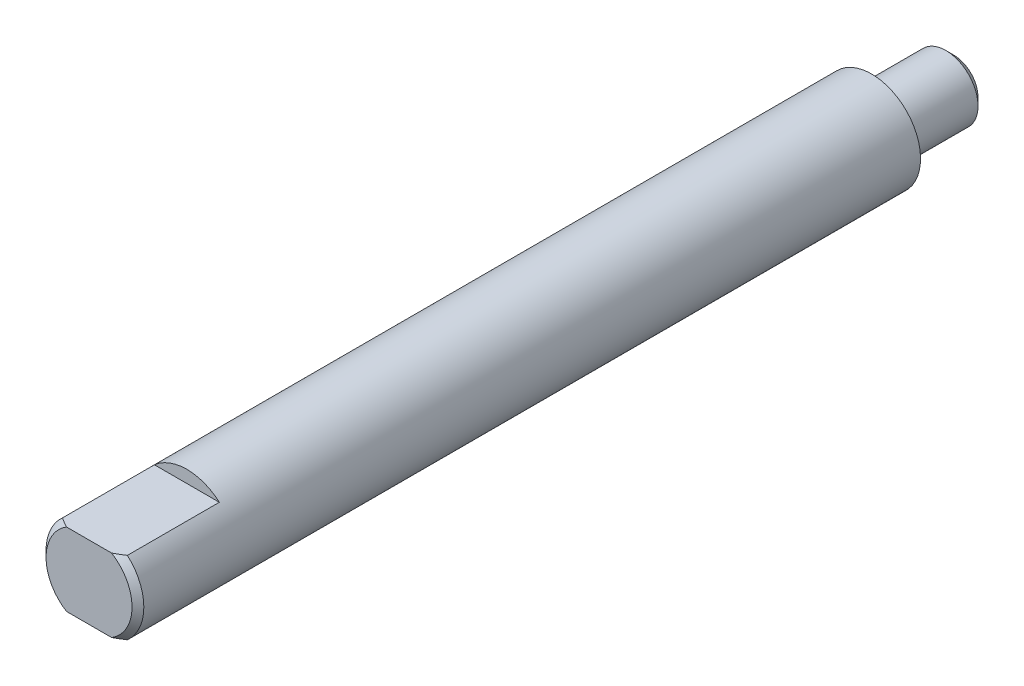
ISO-10303-21;
HEADER;
FILE_DESCRIPTION(('STEP AP214'),'2;1');
FILE_NAME('part.step','',(''),(''),'','','');
FILE_SCHEMA(('AUTOMOTIVE_DESIGN { 1 0 10303 214 1 1 1 1 }'));
ENDSEC;
DATA;
#1=APPLICATION_CONTEXT('core data for automotive mechanical design processes');
#2=APPLICATION_PROTOCOL_DEFINITION('international standard','automotive_design',2000,#1);
#3=PRODUCT_CONTEXT('',#1,'mechanical');
#4=PRODUCT('Part','Part','',(#3));
#5=PRODUCT_RELATED_PRODUCT_CATEGORY('part','',(#4));
#6=PRODUCT_DEFINITION_FORMATION('','',#4);
#7=PRODUCT_DEFINITION_CONTEXT('part definition',#1,'design');
#8=PRODUCT_DEFINITION('design','',#6,#7);
#9=PRODUCT_DEFINITION_SHAPE('','',#8);
#10=(LENGTH_UNIT() NAMED_UNIT(*) SI_UNIT(.MILLI.,.METRE.));
#11=(NAMED_UNIT(*) PLANE_ANGLE_UNIT() SI_UNIT($,.RADIAN.));
#12=(NAMED_UNIT(*) SI_UNIT($,.STERADIAN.) SOLID_ANGLE_UNIT());
#13=UNCERTAINTY_MEASURE_WITH_UNIT(LENGTH_MEASURE(1.E-05),#10,'distance_accuracy_value','');
#14=(GEOMETRIC_REPRESENTATION_CONTEXT(3) GLOBAL_UNCERTAINTY_ASSIGNED_CONTEXT((#13)) GLOBAL_UNIT_ASSIGNED_CONTEXT((#10,
#11,#12)) REPRESENTATION_CONTEXT('',''));
#15=CARTESIAN_POINT('',(0.,0.,0.));
#16=DIRECTION('',(0.,0.,1.));
#17=DIRECTION('',(1.,0.,0.));
#18=AXIS2_PLACEMENT_3D('',#15,#16,#17);
#19=CARTESIAN_POINT('',(0.,0.,3.684));
#20=DIRECTION('',(0.,0.,-1.));
#21=DIRECTION('',(0.,1.,0.));
#22=AXIS2_PLACEMENT_3D('',#19,#20,#21);
#23=CONICAL_SURFACE('',#22,3.175,0.791934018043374);
#24=CARTESIAN_POINT('',(0.,0.,3.684));
#25=DIRECTION('',(0.,0.,1.));
#26=DIRECTION('',(0.,-1.,0.));
#27=AXIS2_PLACEMENT_3D('',#24,#25,#26);
#28=CIRCLE('',#27,3.175);
#29=CARTESIAN_POINT('',(-2.10713075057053,2.37500000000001,3.684));
#30=VERTEX_POINT('',#29);
#31=CARTESIAN_POINT('',(-2.10713075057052,-2.37500000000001,3.684));
#32=VERTEX_POINT('',#31);
#33=EDGE_CURVE('E105',#30,#32,#28,.T.);
#34=ORIENTED_EDGE('',*,*,#33,.T.);
#35=CARTESIAN_POINT('',(-6.62966945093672,-2.37500000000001,-0.133015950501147));
#36=CARTESIAN_POINT('',(-6.4187208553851,-2.37500000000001,0.0629362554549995));
#37=CARTESIAN_POINT('',(-6.20729327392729,-2.37500000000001,0.258380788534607));
#38=CARTESIAN_POINT('',(-5.78286017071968,-2.37500000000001,0.647887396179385));
#39=CARTESIAN_POINT('',(-5.56985352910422,-2.37500000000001,0.841948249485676));
#40=CARTESIAN_POINT('',(-5.13574053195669,-2.37500000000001,1.23363349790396));
#41=CARTESIAN_POINT('',(-4.91457904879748,-2.37500000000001,1.43119690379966));
#42=CARTESIAN_POINT('',(-4.46963283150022,-2.37500000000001,1.82304516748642));
#43=CARTESIAN_POINT('',(-4.24585006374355,-2.37500000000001,2.01733224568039));
#44=CARTESIAN_POINT('',(-3.90719638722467,-2.37500000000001,2.30510248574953));
#45=CARTESIAN_POINT('',(-3.79385459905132,-2.37500000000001,2.40038380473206));
#46=CARTESIAN_POINT('',(-3.56590809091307,-2.37500000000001,2.58942155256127));
#47=CARTESIAN_POINT('',(-3.45130340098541,-2.37500000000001,2.6831780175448));
#48=CARTESIAN_POINT('',(-3.22025369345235,-2.37500000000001,2.86895465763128));
#49=CARTESIAN_POINT('',(-3.10380502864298,-2.37500000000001,2.96097030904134));
#50=CARTESIAN_POINT('',(-2.86892224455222,-2.37500000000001,3.1424196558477));
#51=CARTESIAN_POINT('',(-2.75048831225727,-2.37500000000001,3.23185359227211));
#52=CARTESIAN_POINT('',(-2.51255729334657,-2.37500000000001,3.40617108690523));
#53=CARTESIAN_POINT('',(-2.39309165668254,-2.37500000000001,3.49109735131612));
#54=CARTESIAN_POINT('',(-2.15090508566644,-2.37500000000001,3.65634247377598));
#55=CARTESIAN_POINT('',(-2.02818269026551,-2.37500000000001,3.73665921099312));
#56=CARTESIAN_POINT('',(-1.77912466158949,-2.37500000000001,3.89039659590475));
#57=CARTESIAN_POINT('',(-1.65280524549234,-2.37500000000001,3.96384327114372));
#58=CARTESIAN_POINT('',(-1.39512518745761,-2.37500000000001,4.10119391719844));
#59=CARTESIAN_POINT('',(-1.26377071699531,-2.37500000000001,4.16510912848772));
#60=CARTESIAN_POINT('',(-1.05701971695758,-2.37500000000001,4.25273595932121));
#61=CARTESIAN_POINT('',(-0.983728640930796,-2.37500000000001,4.28140199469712));
#62=CARTESIAN_POINT('',(-0.835356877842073,-2.37500000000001,4.33377721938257));
#63=CARTESIAN_POINT('',(-0.760275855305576,-2.37500000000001,4.35748547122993));
#64=CARTESIAN_POINT('',(-0.608898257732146,-2.37500000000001,4.39885359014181));
#65=CARTESIAN_POINT('',(-0.532610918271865,-2.37500000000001,4.41654679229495));
#66=CARTESIAN_POINT('',(-0.378780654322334,-2.37500000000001,4.44515427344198));
#67=CARTESIAN_POINT('',(-0.301238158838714,-2.37500000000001,4.45607082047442));
#68=CARTESIAN_POINT('',(-0.144559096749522,-2.37500000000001,4.47054748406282));
#69=CARTESIAN_POINT('',(-0.0654144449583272,-2.37500000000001,4.47402190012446));
#70=CARTESIAN_POINT('',(0.0928249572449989,-2.37500000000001,4.47312081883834));
#71=CARTESIAN_POINT('',(0.171919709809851,-2.37500000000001,4.4687456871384));
#72=CARTESIAN_POINT('',(0.329626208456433,-2.37500000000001,4.45241265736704));
#73=CARTESIAN_POINT('',(0.408234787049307,-2.37500000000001,4.44042470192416));
#74=CARTESIAN_POINT('',(0.564086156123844,-2.37500000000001,4.40957980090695));
#75=CARTESIAN_POINT('',(0.64132857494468,-2.37500000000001,4.39072101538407));
#76=CARTESIAN_POINT('',(0.827865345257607,-2.37500000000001,4.33746225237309));
#77=CARTESIAN_POINT('',(0.936246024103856,-2.37500000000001,4.29987709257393));
#78=CARTESIAN_POINT('',(1.1492749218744,-2.37500000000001,4.21535984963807));
#79=CARTESIAN_POINT('',(1.25392057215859,-2.37500000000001,4.16842147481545));
#80=CARTESIAN_POINT('',(1.46087103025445,-2.37500000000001,4.06709514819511));
#81=CARTESIAN_POINT('',(1.56313950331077,-2.37500000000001,4.01263383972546));
#82=CARTESIAN_POINT('',(1.71427099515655,-2.37500000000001,3.92703840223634));
#83=CARTESIAN_POINT('',(1.76426245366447,-2.37500000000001,3.89786057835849));
#84=CARTESIAN_POINT('',(1.86356372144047,-2.37500000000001,3.83837009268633));
#85=CARTESIAN_POINT('',(1.91287355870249,-2.37500000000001,3.80805747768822));
#86=CARTESIAN_POINT('',(2.07522042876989,-2.37500000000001,3.70601224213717));
#87=CARTESIAN_POINT('',(2.18692206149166,-2.37500000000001,3.63215349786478));
#88=CARTESIAN_POINT('',(2.40772318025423,-2.37500000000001,3.48062951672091));
#89=CARTESIAN_POINT('',(2.51682205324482,-2.37500000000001,3.40296339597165));
#90=CARTESIAN_POINT('',(2.73301390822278,-2.37500000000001,3.24473477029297));
#91=CARTESIAN_POINT('',(2.84010537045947,-2.37500000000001,3.1641701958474));
#92=CARTESIAN_POINT('',(3.05261723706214,-2.37500000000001,3.00086187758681));
#93=CARTESIAN_POINT('',(3.15803753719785,-2.37500000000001,2.91811799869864));
#94=CARTESIAN_POINT('',(3.47300086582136,-2.37500000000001,2.66679989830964));
#95=CARTESIAN_POINT('',(3.6805144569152,-2.37500000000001,2.49568568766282));
#96=CARTESIAN_POINT('',(4.09182405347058,-2.37500000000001,2.1492611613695));
#97=CARTESIAN_POINT('',(4.29562161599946,-2.37500000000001,1.97395267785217));
#98=CARTESIAN_POINT('',(4.67931232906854,-2.37500000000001,1.6390553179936));
#99=CARTESIAN_POINT('',(4.85946034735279,-2.37500000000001,1.4797578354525));
#100=CARTESIAN_POINT('',(5.21824582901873,-2.37500000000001,1.15942835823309));
#101=CARTESIAN_POINT('',(5.39688309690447,-2.37500000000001,0.99839614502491));
#102=CARTESIAN_POINT('',(5.75173692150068,-2.37500000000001,0.676174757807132));
#103=CARTESIAN_POINT('',(5.92796166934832,-2.37500000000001,0.514994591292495));
#104=CARTESIAN_POINT('',(6.27946145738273,-2.37500000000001,0.191659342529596));
#105=CARTESIAN_POINT('',(6.45473664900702,-2.37500000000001,0.0295044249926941));
#106=CARTESIAN_POINT('',(6.62966945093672,-2.37500000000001,-0.133015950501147));
#107=B_SPLINE_CURVE_WITH_KNOTS('',3,(#35,#36,#37,#38,#39,#40,#41,#42,#43,#44,#45,#46,#47,#48,
#49,#50,#51,#52,#53,#54,#55,#56,#57,#58,#59,#60,#61,#62,#63,#64,#65,#66,#67,#68,#69,#70,#71,#72,
#73,#74,#75,#76,#77,#78,#79,#80,#81,#82,#83,#84,#85,#86,#87,#88,#89,#90,#91,#92,#93,#94,#95,#96,
#97,#98,#99,#100,#101,#102,#103,#104,#105,#106),.UNSPECIFIED.,.F.,.F.,(4,2,2,2,2,2,2,2,2,2,2,2,
2,2,2,2,2,2,2,2,2,2,2,2,2,2,2,2,2,2,2,2,2,2,2,4),(0.,0.863760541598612,1.72820709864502,
2.61784876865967,3.50686109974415,3.95106286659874,4.39525409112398,4.8404739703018,
5.2856521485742,5.72530383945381,6.16515621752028,6.60326828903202,7.04085953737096,
7.27681206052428,7.51280915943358,7.74747620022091,7.98206465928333,8.21934033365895,
8.45660495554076,8.69481223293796,8.93308334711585,9.27660606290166,9.62036064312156,
9.96774119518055,10.1413805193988,10.3150126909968,10.7166254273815,11.118331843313,
11.5203310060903,11.9223551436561,12.7291420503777,13.535582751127,14.2569976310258,
14.9785044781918,15.6949553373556,16.4112883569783),.UNSPECIFIED.);
#108=CARTESIAN_POINT('',(-1.4640611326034,-2.37500000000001,4.064));
#109=VERTEX_POINT('',#108);
#110=EDGE_CURVE('E128',#32,#109,#107,.T.);
#111=ORIENTED_EDGE('',*,*,#110,.T.);
#112=CARTESIAN_POINT('',(0.,0.,4.064));
#113=DIRECTION('',(0.,0.,1.));
#114=DIRECTION('',(0.,-1.,0.));
#115=AXIS2_PLACEMENT_3D('',#112,#113,#114);
#116=CIRCLE('',#115,2.79);
#117=CARTESIAN_POINT('',(-1.46406113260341,2.37500000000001,4.064));
#118=VERTEX_POINT('',#117);
#119=EDGE_CURVE('E115',#118,#109,#116,.T.);
#120=ORIENTED_EDGE('',*,*,#119,.F.);
#121=CARTESIAN_POINT('',(6.62966945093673,2.37500000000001,-0.133015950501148));
#122=CARTESIAN_POINT('',(6.4187208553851,2.37500000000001,0.062936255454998));
#123=CARTESIAN_POINT('',(6.2072932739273,2.37500000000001,0.258380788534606));
#124=CARTESIAN_POINT('',(5.78286017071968,2.37500000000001,0.647887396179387));
#125=CARTESIAN_POINT('',(5.56985352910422,2.37500000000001,0.841948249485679));
#126=CARTESIAN_POINT('',(5.13574053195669,2.37500000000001,1.23363349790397));
#127=CARTESIAN_POINT('',(4.91457904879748,2.37500000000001,1.43119690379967));
#128=CARTESIAN_POINT('',(4.46963283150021,2.37500000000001,1.82304516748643));
#129=CARTESIAN_POINT('',(4.24585006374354,2.37500000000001,2.0173322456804));
#130=CARTESIAN_POINT('',(3.90719638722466,2.37500000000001,2.30510248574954));
#131=CARTESIAN_POINT('',(3.79385459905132,2.37500000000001,2.40038380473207));
#132=CARTESIAN_POINT('',(3.56590809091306,2.37500000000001,2.58942155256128));
#133=CARTESIAN_POINT('',(3.4513034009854,2.37500000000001,2.68317801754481));
#134=CARTESIAN_POINT('',(3.22025369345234,2.37500000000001,2.86895465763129));
#135=CARTESIAN_POINT('',(3.10380502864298,2.37500000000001,2.96097030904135));
#136=CARTESIAN_POINT('',(2.86892224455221,2.37500000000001,3.14241965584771));
#137=CARTESIAN_POINT('',(2.75048831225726,2.37500000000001,3.23185359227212));
#138=CARTESIAN_POINT('',(2.51255729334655,2.37500000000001,3.40617108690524));
#139=CARTESIAN_POINT('',(2.39309165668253,2.37500000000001,3.49109735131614));
#140=CARTESIAN_POINT('',(2.15090508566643,2.37500000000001,3.65634247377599));
#141=CARTESIAN_POINT('',(2.0281826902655,2.37500000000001,3.73665921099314));
#142=CARTESIAN_POINT('',(1.77912466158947,2.37500000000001,3.89039659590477));
#143=CARTESIAN_POINT('',(1.65280524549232,2.37500000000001,3.96384327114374));
#144=CARTESIAN_POINT('',(1.3951251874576,2.37500000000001,4.10119391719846));
#145=CARTESIAN_POINT('',(1.26377071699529,2.37500000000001,4.16510912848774));
#146=CARTESIAN_POINT('',(1.05701971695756,2.37500000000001,4.25273595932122));
#147=CARTESIAN_POINT('',(0.983728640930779,2.37500000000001,4.28140199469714));
#148=CARTESIAN_POINT('',(0.835356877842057,2.37500000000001,4.33377721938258));
#149=CARTESIAN_POINT('',(0.76027585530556,2.37500000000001,4.35748547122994));
#150=CARTESIAN_POINT('',(0.608898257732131,2.37500000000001,4.39885359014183));
#151=CARTESIAN_POINT('',(0.532610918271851,2.37500000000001,4.41654679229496));
#152=CARTESIAN_POINT('',(0.378780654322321,2.37500000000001,4.44515427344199));
#153=CARTESIAN_POINT('',(0.301238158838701,2.37500000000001,4.45607082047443));
#154=CARTESIAN_POINT('',(0.14455909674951,2.37500000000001,4.47054748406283));
#155=CARTESIAN_POINT('',(0.0654144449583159,2.37500000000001,4.47402190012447));
#156=CARTESIAN_POINT('',(-0.0928249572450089,2.37500000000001,4.47312081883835));
#157=CARTESIAN_POINT('',(-0.17191970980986,2.37500000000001,4.46874568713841));
#158=CARTESIAN_POINT('',(-0.32962620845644,2.37500000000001,4.45241265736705));
#159=CARTESIAN_POINT('',(-0.408234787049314,2.37500000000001,4.44042470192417));
#160=CARTESIAN_POINT('',(-0.56408615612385,2.37500000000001,4.40957980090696));
#161=CARTESIAN_POINT('',(-0.641328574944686,2.37500000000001,4.39072101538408));
#162=CARTESIAN_POINT('',(-0.827865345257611,2.37500000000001,4.3374622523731));
#163=CARTESIAN_POINT('',(-0.936246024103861,2.37500000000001,4.29987709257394));
#164=CARTESIAN_POINT('',(-1.1492749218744,2.37500000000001,4.21535984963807));
#165=CARTESIAN_POINT('',(-1.25392057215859,2.37500000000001,4.16842147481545));
#166=CARTESIAN_POINT('',(-1.46087103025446,2.37500000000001,4.06709514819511));
#167=CARTESIAN_POINT('',(-1.56313950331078,2.37500000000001,4.01263383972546));
#168=CARTESIAN_POINT('',(-1.71427099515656,2.37500000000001,3.92703840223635));
#169=CARTESIAN_POINT('',(-1.76426245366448,2.37500000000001,3.8978605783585));
#170=CARTESIAN_POINT('',(-1.86356372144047,2.37500000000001,3.83837009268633));
#171=CARTESIAN_POINT('',(-1.9128735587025,2.37500000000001,3.80805747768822));
#172=CARTESIAN_POINT('',(-2.0752204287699,2.37500000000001,3.70601224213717));
#173=CARTESIAN_POINT('',(-2.18692206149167,2.37500000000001,3.63215349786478));
#174=CARTESIAN_POINT('',(-2.40772318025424,2.37500000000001,3.48062951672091));
#175=CARTESIAN_POINT('',(-2.51682205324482,2.37500000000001,3.40296339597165));
#176=CARTESIAN_POINT('',(-2.73301390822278,2.37500000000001,3.24473477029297));
#177=CARTESIAN_POINT('',(-2.84010537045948,2.37500000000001,3.1641701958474));
#178=CARTESIAN_POINT('',(-3.05261723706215,2.37500000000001,3.00086187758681));
#179=CARTESIAN_POINT('',(-3.15803753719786,2.37500000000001,2.91811799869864));
#180=CARTESIAN_POINT('',(-3.47300086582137,2.37500000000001,2.66679989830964));
#181=CARTESIAN_POINT('',(-3.68051445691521,2.37500000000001,2.49568568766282));
#182=CARTESIAN_POINT('',(-4.09182405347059,2.37500000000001,2.1492611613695));
#183=CARTESIAN_POINT('',(-4.29562161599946,2.37500000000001,1.97395267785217));
#184=CARTESIAN_POINT('',(-4.67931232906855,2.37500000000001,1.6390553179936));
#185=CARTESIAN_POINT('',(-4.8594603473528,2.37500000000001,1.47975783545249));
#186=CARTESIAN_POINT('',(-5.21824582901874,2.37500000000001,1.15942835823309));
#187=CARTESIAN_POINT('',(-5.39688309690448,2.37500000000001,0.998396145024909));
#188=CARTESIAN_POINT('',(-5.75173692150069,2.37500000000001,0.676174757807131));
#189=CARTESIAN_POINT('',(-5.92796166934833,2.37500000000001,0.514994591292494));
#190=CARTESIAN_POINT('',(-6.27946145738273,2.37500000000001,0.191659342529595));
#191=CARTESIAN_POINT('',(-6.45473664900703,2.37500000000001,0.029504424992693));
#192=CARTESIAN_POINT('',(-6.62966945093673,2.37500000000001,-0.133015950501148));
#193=B_SPLINE_CURVE_WITH_KNOTS('',3,(#121,#122,#123,#124,#125,#126,#127,#128,#129,#130,#131,
#132,#133,#134,#135,#136,#137,#138,#139,#140,#141,#142,#143,#144,#145,#146,#147,#148,#149,#150,
#151,#152,#153,#154,#155,#156,#157,#158,#159,#160,#161,#162,#163,#164,#165,#166,#167,#168,#169,
#170,#171,#172,#173,#174,#175,#176,#177,#178,#179,#180,#181,#182,#183,#184,#185,#186,#187,#188,
#189,#190,#191,#192),.UNSPECIFIED.,.F.,.F.,(4,2,2,2,2,2,2,2,2,2,2,2,2,2,2,2,2,2,2,2,2,2,2,2,2,2,
2,2,2,2,2,2,2,2,2,4),(0.,0.863760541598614,1.72820709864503,2.61784876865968,3.50686109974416,
3.95106286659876,4.395254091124,4.84047397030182,5.28565214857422,5.72530383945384,
6.16515621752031,6.60326828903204,7.04085953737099,7.27681206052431,7.5128091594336,
7.74747620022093,7.98206465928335,8.21934033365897,8.45660495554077,8.69481223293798,
8.93308334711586,9.27660606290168,9.62036064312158,9.96774119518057,10.1413805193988,
10.3150126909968,10.7166254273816,11.118331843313,11.5203310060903,11.9223551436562,
12.7291420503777,13.535582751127,14.2569976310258,14.9785044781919,15.6949553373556,
16.4112883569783),.UNSPECIFIED.);
#194=EDGE_CURVE('E129',#118,#30,#193,.T.);
#195=ORIENTED_EDGE('',*,*,#194,.T.);
#196=EDGE_LOOP('',(#34,#111,#120,#195));
#197=FACE_BOUND('',#196,.T.);
#198=ADVANCED_FACE('F33',(#197),#23,.T.);
#199=CARTESIAN_POINT('',(0.,0.,4.064));
#200=DIRECTION('',(0.,0.,-1.));
#201=DIRECTION('',(0.,1.,0.));
#202=AXIS2_PLACEMENT_3D('',#199,#200,#201);
#203=PLANE('',#202);
#204=ORIENTED_EDGE('',*,*,#119,.T.);
#205=DIRECTION('',(1.,0.,0.));
#206=VECTOR('',#205,1.);
#207=CARTESIAN_POINT('',(-5.,-2.37500000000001,4.064));
#208=LINE('',#207,#206);
#209=CARTESIAN_POINT('',(1.4640611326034,-2.37500000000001,4.064));
#210=VERTEX_POINT('',#209);
#211=EDGE_CURVE('E95',#109,#210,#208,.T.);
#212=ORIENTED_EDGE('',*,*,#211,.T.);
#213=CARTESIAN_POINT('',(1.46406113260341,2.37500000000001,4.064));
#214=VERTEX_POINT('',#213);
#215=EDGE_CURVE('E109',#210,#214,#116,.T.);
#216=ORIENTED_EDGE('',*,*,#215,.T.);
#217=DIRECTION('',(1.,0.,0.));
#218=VECTOR('',#217,1.);
#219=CARTESIAN_POINT('',(-5.,2.37500000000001,4.064));
#220=LINE('',#219,#218);
#221=EDGE_CURVE('E135',#118,#214,#220,.T.);
#222=ORIENTED_EDGE('',*,*,#221,.F.);
#223=EDGE_LOOP('',(#204,#212,#216,#222));
#224=FACE_BOUND('',#223,.T.);
#225=ADVANCED_FACE('F35',(#224),#203,.F.);
#226=ORIENTED_EDGE('',*,*,#215,.F.);
#227=CARTESIAN_POINT('',(2.10713075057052,-2.37500000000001,3.684));
#228=VERTEX_POINT('',#227);
#229=EDGE_CURVE('E94',#210,#228,#107,.T.);
#230=ORIENTED_EDGE('',*,*,#229,.T.);
#231=CARTESIAN_POINT('',(2.10713075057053,2.37500000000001,3.684));
#232=VERTEX_POINT('',#231);
#233=EDGE_CURVE('E101',#228,#232,#28,.T.);
#234=ORIENTED_EDGE('',*,*,#233,.T.);
#235=EDGE_CURVE('E132',#232,#214,#193,.T.);
#236=ORIENTED_EDGE('',*,*,#235,.T.);
#237=EDGE_LOOP('',(#226,#230,#234,#236));
#238=FACE_BOUND('',#237,.T.);
#239=ADVANCED_FACE('F144',(#238),#23,.T.);
#240=CARTESIAN_POINT('',(0.,0.,4.064));
#241=DIRECTION('',(0.,0.,1.));
#242=DIRECTION('',(0.,-1.,0.));
#243=AXIS2_PLACEMENT_3D('',#240,#241,#242);
#244=CYLINDRICAL_SURFACE('',#243,3.17499999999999);
#245=ORIENTED_EDGE('',*,*,#233,.F.);
#246=DIRECTION('',(0.,0.,1.));
#247=VECTOR('',#246,1.);
#248=CARTESIAN_POINT('',(2.10713075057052,-2.37500000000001,4.064));
#249=LINE('',#248,#247);
#250=CARTESIAN_POINT('',(2.10713075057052,-2.37500000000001,-2.286));
#251=VERTEX_POINT('',#250);
#252=EDGE_CURVE('E11',#228,#251,#249,.F.);
#253=ORIENTED_EDGE('',*,*,#252,.T.);
#254=CARTESIAN_POINT('',(0.,0.,-2.286));
#255=DIRECTION('',(0.,0.,-1.));
#256=DIRECTION('',(-1.,0.,0.));
#257=AXIS2_PLACEMENT_3D('',#254,#255,#256);
#258=CIRCLE('',#257,3.17499999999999);
#259=CARTESIAN_POINT('',(-2.10713075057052,-2.37500000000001,-2.286));
#260=VERTEX_POINT('',#259);
#261=EDGE_CURVE('E85',#251,#260,#258,.T.);
#262=ORIENTED_EDGE('',*,*,#261,.T.);
#263=DIRECTION('',(0.,0.,1.));
#264=VECTOR('',#263,1.);
#265=CARTESIAN_POINT('',(-2.10713075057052,-2.37500000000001,4.064));
#266=LINE('',#265,#264);
#267=EDGE_CURVE('E41',#260,#32,#266,.T.);
#268=ORIENTED_EDGE('',*,*,#267,.T.);
#269=ORIENTED_EDGE('',*,*,#33,.F.);
#270=DIRECTION('',(0.,0.,1.));
#271=VECTOR('',#270,1.);
#272=CARTESIAN_POINT('',(-2.10713075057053,2.37500000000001,4.064));
#273=LINE('',#272,#271);
#274=CARTESIAN_POINT('',(-2.10713075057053,2.37500000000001,-2.286));
#275=VERTEX_POINT('',#274);
#276=EDGE_CURVE('E118',#30,#275,#273,.F.);
#277=ORIENTED_EDGE('',*,*,#276,.T.);
#278=CARTESIAN_POINT('',(0.,0.,-2.286));
#279=DIRECTION('',(0.,0.,-1.));
#280=DIRECTION('',(-1.,0.,0.));
#281=AXIS2_PLACEMENT_3D('',#278,#279,#280);
#282=CIRCLE('',#281,3.17499999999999);
#283=CARTESIAN_POINT('',(2.10713075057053,2.37500000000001,-2.286));
#284=VERTEX_POINT('',#283);
#285=EDGE_CURVE('E121',#275,#284,#282,.T.);
#286=ORIENTED_EDGE('',*,*,#285,.T.);
#287=DIRECTION('',(0.,0.,1.));
#288=VECTOR('',#287,1.);
#289=CARTESIAN_POINT('',(2.10713075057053,2.37500000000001,4.064));
#290=LINE('',#289,#288);
#291=EDGE_CURVE('E89',#284,#232,#290,.T.);
#292=ORIENTED_EDGE('',*,*,#291,.T.);
#293=EDGE_LOOP('',(#245,#253,#262,#268,#269,#277,#286,#292));
#294=FACE_BOUND('',#293,.T.);
#295=CARTESIAN_POINT('',(0.,0.,-46.736));
#296=DIRECTION('',(0.,0.,1.));
#297=DIRECTION('',(0.,-1.,0.));
#298=AXIS2_PLACEMENT_3D('',#295,#296,#297);
#299=CIRCLE('',#298,3.17499999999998);
#300=CARTESIAN_POINT('',(0.,-3.17499999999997,-46.736));
#301=VERTEX_POINT('',#300);
#302=EDGE_CURVE('E106',#301,#301,#299,.T.);
#303=ORIENTED_EDGE('',*,*,#302,.T.);
#304=EDGE_LOOP('',(#303));
#305=FACE_BOUND('',#304,.T.);
#306=ADVANCED_FACE('F98',(#294,#305),#244,.T.);
#307=CARTESIAN_POINT('',(0.,2.08280000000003,-46.736));
#308=DIRECTION('',(0.,0.,1.));
#309=DIRECTION('',(0.,-1.,0.));
#310=AXIS2_PLACEMENT_3D('',#307,#308,#309);
#311=PLANE('',#310);
#312=ORIENTED_EDGE('',*,*,#302,.F.);
#313=EDGE_LOOP('',(#312));
#314=FACE_BOUND('',#313,.T.);
#315=CARTESIAN_POINT('',(0.,0.,-46.736));
#316=DIRECTION('',(0.,0.,1.));
#317=DIRECTION('',(0.,-1.,0.));
#318=AXIS2_PLACEMENT_3D('',#315,#316,#317);
#319=CIRCLE('',#318,2.08280000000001);
#320=CARTESIAN_POINT('',(0.,-2.0828,-46.736));
#321=VERTEX_POINT('',#320);
#322=EDGE_CURVE('E111',#321,#321,#319,.T.);
#323=ORIENTED_EDGE('',*,*,#322,.T.);
#324=EDGE_LOOP('',(#323));
#325=FACE_BOUND('',#324,.T.);
#326=ADVANCED_FACE('F165',(#314,#325),#311,.F.);
#327=CARTESIAN_POINT('',(0.,0.,4.064));
#328=DIRECTION('',(0.,0.,1.));
#329=DIRECTION('',(0.,-1.,0.));
#330=AXIS2_PLACEMENT_3D('',#327,#328,#329);
#331=CYLINDRICAL_SURFACE('',#330,2.08280000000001);
#332=ORIENTED_EDGE('',*,*,#322,.F.);
#333=EDGE_LOOP('',(#332));
#334=FACE_BOUND('',#333,.T.);
#335=CARTESIAN_POINT('',(0.,0.,-51.56));
#336=DIRECTION('',(0.,0.,1.));
#337=DIRECTION('',(0.,-1.,0.));
#338=AXIS2_PLACEMENT_3D('',#335,#336,#337);
#339=CIRCLE('',#338,2.08280000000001);
#340=CARTESIAN_POINT('',(0.,-2.08279999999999,-51.56));
#341=VERTEX_POINT('',#340);
#342=EDGE_CURVE('E263',#341,#341,#339,.T.);
#343=ORIENTED_EDGE('',*,*,#342,.T.);
#344=EDGE_LOOP('',(#343));
#345=FACE_BOUND('',#344,.T.);
#346=ADVANCED_FACE('F161',(#334,#345),#331,.T.);
#347=CARTESIAN_POINT('',(0.,0.,-52.07));
#348=DIRECTION('',(0.,0.,1.));
#349=DIRECTION('',(0.,-1.,0.));
#350=AXIS2_PLACEMENT_3D('',#347,#348,#349);
#351=CONICAL_SURFACE('',#350,1.57,0.788135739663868);
#352=ORIENTED_EDGE('',*,*,#342,.F.);
#353=EDGE_LOOP('',(#352));
#354=FACE_BOUND('',#353,.T.);
#355=CARTESIAN_POINT('',(0.,0.,-52.07));
#356=DIRECTION('',(0.,0.,1.));
#357=DIRECTION('',(0.,-1.,0.));
#358=AXIS2_PLACEMENT_3D('',#355,#356,#357);
#359=CIRCLE('',#358,1.57);
#360=CARTESIAN_POINT('',(0.,-1.56999999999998,-52.07));
#361=VERTEX_POINT('',#360);
#362=EDGE_CURVE('E134',#361,#361,#359,.T.);
#363=ORIENTED_EDGE('',*,*,#362,.T.);
#364=EDGE_LOOP('',(#363));
#365=FACE_BOUND('',#364,.T.);
#366=ADVANCED_FACE('F157',(#354,#365),#351,.T.);
#367=CARTESIAN_POINT('',(0.,0.,-52.07));
#368=DIRECTION('',(0.,0.,1.));
#369=DIRECTION('',(0.,-1.,0.));
#370=AXIS2_PLACEMENT_3D('',#367,#368,#369);
#371=PLANE('',#370);
#372=ORIENTED_EDGE('',*,*,#362,.F.);
#373=EDGE_LOOP('',(#372));
#374=FACE_BOUND('',#373,.T.);
#375=ADVANCED_FACE('F154',(#374),#371,.F.);
#376=CARTESIAN_POINT('',(-5.,2.37500000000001,-2.286));
#377=DIRECTION('',(0.,0.,-1.));
#378=DIRECTION('',(-1.,0.,0.));
#379=AXIS2_PLACEMENT_3D('',#376,#377,#378);
#380=PLANE('',#379);
#381=DIRECTION('',(1.,0.,0.));
#382=VECTOR('',#381,1.);
#383=CARTESIAN_POINT('',(-5.,2.37500000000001,-2.286));
#384=LINE('',#383,#382);
#385=EDGE_CURVE('E55',#275,#284,#384,.T.);
#386=ORIENTED_EDGE('',*,*,#385,.T.);
#387=ORIENTED_EDGE('',*,*,#285,.F.);
#388=EDGE_LOOP('',(#386,#387));
#389=FACE_BOUND('',#388,.T.);
#390=ADVANCED_FACE('F152',(#389),#380,.F.);
#391=CARTESIAN_POINT('',(-5.,2.37500000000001,4.064));
#392=DIRECTION('',(0.,-1.,0.));
#393=DIRECTION('',(0.,0.,-1.));
#394=AXIS2_PLACEMENT_3D('',#391,#392,#393);
#395=PLANE('',#394);
#396=ORIENTED_EDGE('',*,*,#291,.F.);
#397=ORIENTED_EDGE('',*,*,#385,.F.);
#398=ORIENTED_EDGE('',*,*,#276,.F.);
#399=ORIENTED_EDGE('',*,*,#194,.F.);
#400=ORIENTED_EDGE('',*,*,#221,.T.);
#401=ORIENTED_EDGE('',*,*,#235,.F.);
#402=EDGE_LOOP('',(#396,#397,#398,#399,#400,#401));
#403=FACE_BOUND('',#402,.T.);
#404=ADVANCED_FACE('F147',(#403),#395,.F.);
#405=CARTESIAN_POINT('',(-5.,-2.37500000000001,4.064));
#406=DIRECTION('',(0.,1.,0.));
#407=DIRECTION('',(0.,0.,1.));
#408=AXIS2_PLACEMENT_3D('',#405,#406,#407);
#409=PLANE('',#408);
#410=ORIENTED_EDGE('',*,*,#267,.F.);
#411=DIRECTION('',(1.,0.,0.));
#412=VECTOR('',#411,1.);
#413=CARTESIAN_POINT('',(-5.,-2.37500000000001,-2.286));
#414=LINE('',#413,#412);
#415=EDGE_CURVE('E47',#260,#251,#414,.T.);
#416=ORIENTED_EDGE('',*,*,#415,.T.);
#417=ORIENTED_EDGE('',*,*,#252,.F.);
#418=ORIENTED_EDGE('',*,*,#229,.F.);
#419=ORIENTED_EDGE('',*,*,#211,.F.);
#420=ORIENTED_EDGE('',*,*,#110,.F.);
#421=EDGE_LOOP('',(#410,#416,#417,#418,#419,#420));
#422=FACE_BOUND('',#421,.T.);
#423=ADVANCED_FACE('F92',(#422),#409,.F.);
#424=CARTESIAN_POINT('',(-5.,-2.37500000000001,-2.286));
#425=DIRECTION('',(0.,0.,-1.));
#426=DIRECTION('',(-1.,0.,0.));
#427=AXIS2_PLACEMENT_3D('',#424,#425,#426);
#428=PLANE('',#427);
#429=ORIENTED_EDGE('',*,*,#415,.F.);
#430=ORIENTED_EDGE('',*,*,#261,.F.);
#431=EDGE_LOOP('',(#429,#430));
#432=FACE_BOUND('',#431,.T.);
#433=ADVANCED_FACE('F86',(#432),#428,.F.);
#434=CLOSED_SHELL('',(#198,#225,#239,#306,#326,#346,#366,#375,#390,#404,#423,#433));
#435=MANIFOLD_SOLID_BREP('B2',#434);
#436=ADVANCED_BREP_SHAPE_REPRESENTATION('',(#18,#435),#14);
#437=SHAPE_DEFINITION_REPRESENTATION(#9,#436);
ENDSEC;
END-ISO-10303-21;
